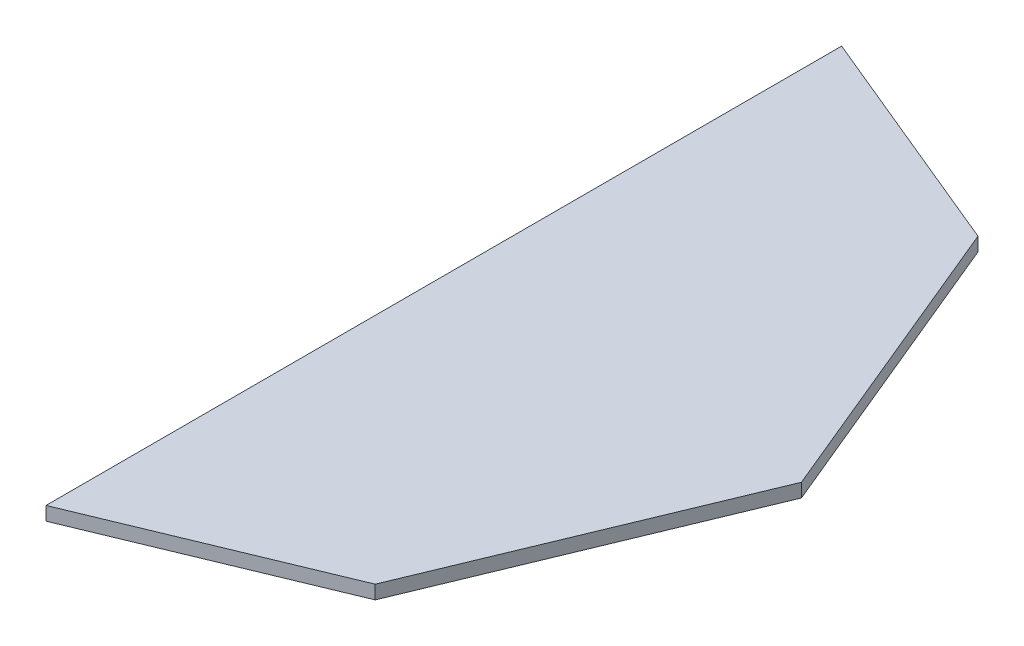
ISO-10303-21;
HEADER;
FILE_DESCRIPTION(('STEP AP214'),'2;1');
FILE_NAME('part.step','',(''),(''),'','','');
FILE_SCHEMA(('AUTOMOTIVE_DESIGN { 1 0 10303 214 1 1 1 1 }'));
ENDSEC;
DATA;
#1=APPLICATION_CONTEXT('core data for automotive mechanical design processes');
#2=APPLICATION_PROTOCOL_DEFINITION('international standard','automotive_design',2000,#1);
#3=PRODUCT_CONTEXT('',#1,'mechanical');
#4=PRODUCT('Part','Part','',(#3));
#5=PRODUCT_RELATED_PRODUCT_CATEGORY('part','',(#4));
#6=PRODUCT_DEFINITION_FORMATION('','',#4);
#7=PRODUCT_DEFINITION_CONTEXT('part definition',#1,'design');
#8=PRODUCT_DEFINITION('design','',#6,#7);
#9=PRODUCT_DEFINITION_SHAPE('','',#8);
#10=(LENGTH_UNIT() NAMED_UNIT(*) SI_UNIT(.MILLI.,.METRE.));
#11=(NAMED_UNIT(*) PLANE_ANGLE_UNIT() SI_UNIT($,.RADIAN.));
#12=(NAMED_UNIT(*) SI_UNIT($,.STERADIAN.) SOLID_ANGLE_UNIT());
#13=UNCERTAINTY_MEASURE_WITH_UNIT(LENGTH_MEASURE(1.E-05),#10,'distance_accuracy_value','');
#14=(GEOMETRIC_REPRESENTATION_CONTEXT(3) GLOBAL_UNCERTAINTY_ASSIGNED_CONTEXT((#13)) GLOBAL_UNIT_ASSIGNED_CONTEXT((#10,
#11,#12)) REPRESENTATION_CONTEXT('',''));
#15=CARTESIAN_POINT('',(0.,0.,0.));
#16=DIRECTION('',(0.,0.,1.));
#17=DIRECTION('',(1.,0.,0.));
#18=AXIS2_PLACEMENT_3D('',#15,#16,#17);
#19=CARTESIAN_POINT('',(265.165042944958,12.,-265.165042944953));
#20=DIRECTION('',(-0.382683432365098,0.,0.923879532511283));
#21=DIRECTION('',(0.923879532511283,0.,0.382683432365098));
#22=AXIS2_PLACEMENT_3D('',#19,#20,#21);
#23=PLANE('',#22);
#24=DIRECTION('',(-0.923879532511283,0.,-0.382683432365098));
#25=VECTOR('',#24,1.);
#26=CARTESIAN_POINT('',(265.165042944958,0.,-265.165042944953));
#27=LINE('',#26,#25);
#28=CARTESIAN_POINT('',(265.165042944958,0.,-265.165042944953));
#29=VERTEX_POINT('',#28);
#30=CARTESIAN_POINT('',(60.3553390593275,0.,-350.000000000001));
#31=VERTEX_POINT('',#30);
#32=EDGE_CURVE('E106',#29,#31,#27,.T.);
#33=ORIENTED_EDGE('',*,*,#32,.T.);
#34=DIRECTION('',(0.,-1.,0.));
#35=VECTOR('',#34,1.);
#36=CARTESIAN_POINT('',(60.3553390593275,12.,-350.000000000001));
#37=LINE('',#36,#35);
#38=CARTESIAN_POINT('',(60.3553390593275,12.,-350.000000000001));
#39=VERTEX_POINT('',#38);
#40=EDGE_CURVE('E11',#39,#31,#37,.T.);
#41=ORIENTED_EDGE('',*,*,#40,.F.);
#42=DIRECTION('',(-0.923879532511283,0.,-0.382683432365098));
#43=VECTOR('',#42,1.);
#44=CARTESIAN_POINT('',(265.165042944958,12.,-265.165042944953));
#45=LINE('',#44,#43);
#46=CARTESIAN_POINT('',(265.165042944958,12.,-265.165042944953));
#47=VERTEX_POINT('',#46);
#48=EDGE_CURVE('E114',#47,#39,#45,.T.);
#49=ORIENTED_EDGE('',*,*,#48,.F.);
#50=DIRECTION('',(0.,-1.,0.));
#51=VECTOR('',#50,1.);
#52=CARTESIAN_POINT('',(265.165042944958,12.,-265.165042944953));
#53=LINE('',#52,#51);
#54=EDGE_CURVE('E102',#47,#29,#53,.T.);
#55=ORIENTED_EDGE('',*,*,#54,.T.);
#56=EDGE_LOOP('',(#33,#41,#49,#55));
#57=FACE_BOUND('',#56,.T.);
#58=ADVANCED_FACE('F32',(#57),#23,.F.);
#59=CARTESIAN_POINT('',(60.3553390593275,12.,-350.000000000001));
#60=DIRECTION('',(1.,0.,0.));
#61=DIRECTION('',(0.,0.,-1.));
#62=AXIS2_PLACEMENT_3D('',#59,#60,#61);
#63=PLANE('',#62);
#64=DIRECTION('',(0.,0.,1.));
#65=VECTOR('',#64,1.);
#66=CARTESIAN_POINT('',(60.3553390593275,0.,-350.000000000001));
#67=LINE('',#66,#65);
#68=CARTESIAN_POINT('',(60.3553390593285,0.,349.999999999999));
#69=VERTEX_POINT('',#68);
#70=EDGE_CURVE('E109',#31,#69,#67,.T.);
#71=ORIENTED_EDGE('',*,*,#70,.T.);
#72=DIRECTION('',(0.,-1.,0.));
#73=VECTOR('',#72,1.);
#74=CARTESIAN_POINT('',(60.3553390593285,12.,349.999999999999));
#75=LINE('',#74,#73);
#76=CARTESIAN_POINT('',(60.3553390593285,12.,349.999999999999));
#77=VERTEX_POINT('',#76);
#78=EDGE_CURVE('E40',#77,#69,#75,.T.);
#79=ORIENTED_EDGE('',*,*,#78,.F.);
#80=DIRECTION('',(0.,0.,1.));
#81=VECTOR('',#80,1.);
#82=CARTESIAN_POINT('',(60.3553390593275,12.,-350.000000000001));
#83=LINE('',#82,#81);
#84=EDGE_CURVE('E82',#39,#77,#83,.T.);
#85=ORIENTED_EDGE('',*,*,#84,.F.);
#86=ORIENTED_EDGE('',*,*,#40,.T.);
#87=EDGE_LOOP('',(#71,#79,#85,#86));
#88=FACE_BOUND('',#87,.T.);
#89=ADVANCED_FACE('F133',(#88),#63,.F.);
#90=CARTESIAN_POINT('',(60.3553390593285,12.,349.999999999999));
#91=DIRECTION('',(-0.382683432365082,0.,-0.92387953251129));
#92=DIRECTION('',(-0.92387953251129,0.,0.382683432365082));
#93=AXIS2_PLACEMENT_3D('',#90,#91,#92);
#94=PLANE('',#93);
#95=DIRECTION('',(0.92387953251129,0.,-0.382683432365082));
#96=VECTOR('',#95,1.);
#97=CARTESIAN_POINT('',(60.3553390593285,0.,349.999999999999));
#98=LINE('',#97,#96);
#99=CARTESIAN_POINT('',(265.165042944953,0.,265.165042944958));
#100=VERTEX_POINT('',#99);
#101=EDGE_CURVE('E97',#69,#100,#98,.T.);
#102=ORIENTED_EDGE('',*,*,#101,.T.);
#103=DIRECTION('',(0.,-1.,0.));
#104=VECTOR('',#103,1.);
#105=CARTESIAN_POINT('',(265.165042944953,12.,265.165042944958));
#106=LINE('',#105,#104);
#107=CARTESIAN_POINT('',(265.165042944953,12.,265.165042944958));
#108=VERTEX_POINT('',#107);
#109=EDGE_CURVE('E94',#108,#100,#106,.T.);
#110=ORIENTED_EDGE('',*,*,#109,.F.);
#111=DIRECTION('',(0.92387953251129,0.,-0.382683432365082));
#112=VECTOR('',#111,1.);
#113=CARTESIAN_POINT('',(60.3553390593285,12.,349.999999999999));
#114=LINE('',#113,#112);
#115=EDGE_CURVE('E86',#77,#108,#114,.T.);
#116=ORIENTED_EDGE('',*,*,#115,.F.);
#117=ORIENTED_EDGE('',*,*,#78,.T.);
#118=EDGE_LOOP('',(#102,#110,#116,#117));
#119=FACE_BOUND('',#118,.T.);
#120=ADVANCED_FACE('F95',(#119),#94,.F.);
#121=CARTESIAN_POINT('',(265.165042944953,12.,265.165042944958));
#122=DIRECTION('',(-0.923879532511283,0.,-0.382683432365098));
#123=DIRECTION('',(-0.382683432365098,0.,0.923879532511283));
#124=AXIS2_PLACEMENT_3D('',#121,#122,#123);
#125=PLANE('',#124);
#126=DIRECTION('',(0.382683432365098,0.,-0.923879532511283));
#127=VECTOR('',#126,1.);
#128=CARTESIAN_POINT('',(265.165042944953,0.,265.165042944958));
#129=LINE('',#128,#127);
#130=CARTESIAN_POINT('',(375.,0.,3.45705505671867E-12));
#131=VERTEX_POINT('',#130);
#132=EDGE_CURVE('E68',#100,#131,#129,.T.);
#133=ORIENTED_EDGE('',*,*,#132,.T.);
#134=DIRECTION('',(0.,-1.,0.));
#135=VECTOR('',#134,1.);
#136=CARTESIAN_POINT('',(375.,12.,3.45705505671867E-12));
#137=LINE('',#136,#135);
#138=CARTESIAN_POINT('',(375.,12.,3.45705505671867E-12));
#139=VERTEX_POINT('',#138);
#140=EDGE_CURVE('E98',#139,#131,#137,.T.);
#141=ORIENTED_EDGE('',*,*,#140,.F.);
#142=DIRECTION('',(0.382683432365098,0.,-0.923879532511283));
#143=VECTOR('',#142,1.);
#144=CARTESIAN_POINT('',(265.165042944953,12.,265.165042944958));
#145=LINE('',#144,#143);
#146=EDGE_CURVE('E90',#108,#139,#145,.T.);
#147=ORIENTED_EDGE('',*,*,#146,.F.);
#148=ORIENTED_EDGE('',*,*,#109,.T.);
#149=EDGE_LOOP('',(#133,#141,#147,#148));
#150=FACE_BOUND('',#149,.T.);
#151=ADVANCED_FACE('F100',(#150),#125,.F.);
#152=CARTESIAN_POINT('',(375.,12.,3.45705505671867E-12));
#153=DIRECTION('',(-0.92387953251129,0.,0.382683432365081));
#154=DIRECTION('',(0.382683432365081,0.,0.92387953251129));
#155=AXIS2_PLACEMENT_3D('',#152,#153,#154);
#156=PLANE('',#155);
#157=DIRECTION('',(-0.382683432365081,0.,-0.92387953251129));
#158=VECTOR('',#157,1.);
#159=CARTESIAN_POINT('',(375.,0.,3.45705505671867E-12));
#160=LINE('',#159,#158);
#161=EDGE_CURVE('E74',#131,#29,#160,.T.);
#162=ORIENTED_EDGE('',*,*,#161,.T.);
#163=ORIENTED_EDGE('',*,*,#54,.F.);
#164=DIRECTION('',(-0.382683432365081,0.,-0.92387953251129));
#165=VECTOR('',#164,1.);
#166=CARTESIAN_POINT('',(375.,12.,3.45705505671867E-12));
#167=LINE('',#166,#165);
#168=EDGE_CURVE('E48',#139,#47,#167,.T.);
#169=ORIENTED_EDGE('',*,*,#168,.F.);
#170=ORIENTED_EDGE('',*,*,#140,.T.);
#171=EDGE_LOOP('',(#162,#163,#169,#170));
#172=FACE_BOUND('',#171,.T.);
#173=ADVANCED_FACE('F122',(#172),#156,.F.);
#174=CARTESIAN_POINT('',(0.,12.,0.));
#175=DIRECTION('',(0.,-1.,0.));
#176=DIRECTION('',(0.,0.,-1.));
#177=AXIS2_PLACEMENT_3D('',#174,#175,#176);
#178=PLANE('',#177);
#179=ORIENTED_EDGE('',*,*,#48,.T.);
#180=ORIENTED_EDGE('',*,*,#84,.T.);
#181=ORIENTED_EDGE('',*,*,#115,.T.);
#182=ORIENTED_EDGE('',*,*,#146,.T.);
#183=ORIENTED_EDGE('',*,*,#168,.T.);
#184=EDGE_LOOP('',(#179,#180,#181,#182,#183));
#185=FACE_BOUND('',#184,.T.);
#186=ADVANCED_FACE('F88',(#185),#178,.F.);
#187=CARTESIAN_POINT('',(0.,0.,0.));
#188=DIRECTION('',(0.,-1.,0.));
#189=DIRECTION('',(0.,0.,-1.));
#190=AXIS2_PLACEMENT_3D('',#187,#188,#189);
#191=PLANE('',#190);
#192=ORIENTED_EDGE('',*,*,#32,.F.);
#193=ORIENTED_EDGE('',*,*,#161,.F.);
#194=ORIENTED_EDGE('',*,*,#132,.F.);
#195=ORIENTED_EDGE('',*,*,#101,.F.);
#196=ORIENTED_EDGE('',*,*,#70,.F.);
#197=EDGE_LOOP('',(#192,#193,#194,#195,#196));
#198=FACE_BOUND('',#197,.T.);
#199=ADVANCED_FACE('F118',(#198),#191,.T.);
#200=CLOSED_SHELL('',(#58,#89,#120,#151,#173,#186,#199));
#201=MANIFOLD_SOLID_BREP('B2',#200);
#202=ADVANCED_BREP_SHAPE_REPRESENTATION('',(#18,#201),#14);
#203=SHAPE_DEFINITION_REPRESENTATION(#9,#202);
ENDSEC;
END-ISO-10303-21;
